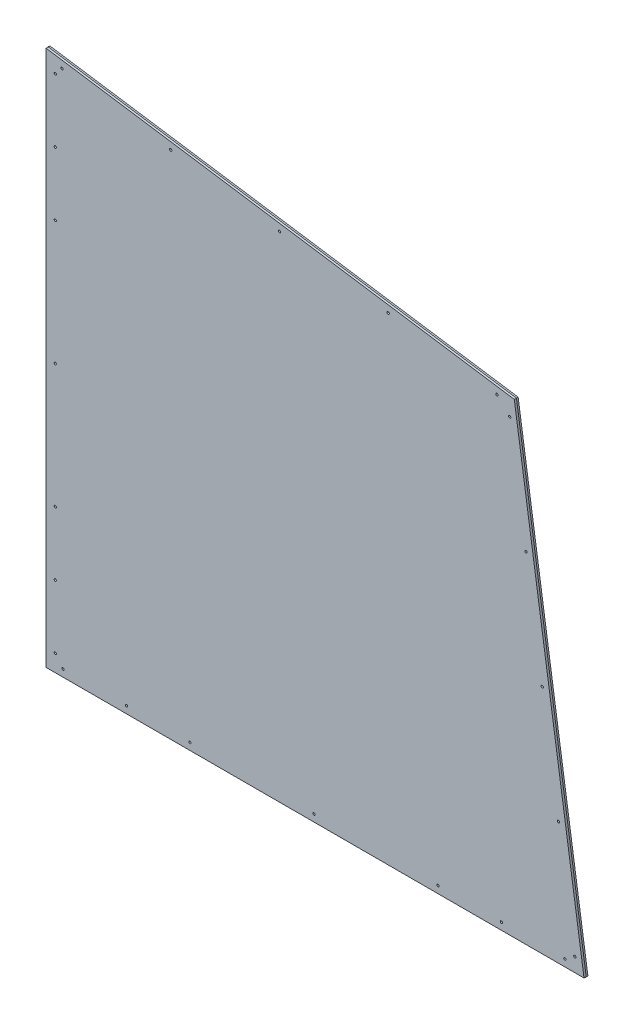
from build123d import *

# Parameters (mm, degrees)
BOSS_EXTRUDE1_DEPTH = 4.365625
CUT_EXTRUDE1_DEPTH  = 1734.85299245
CUT_EXTRUDE2_DEPTH  = 1731.733684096
SKETCH5_R           = 2.57937
CUT_EXTRUDE3_DEPTH  = 1715.789562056


with BuildPart() as part:
    # Sketch2 → Boss-Extrude1 (new, symmetric)
    with BuildSketch(Plane.XY):
        Polygon((0, 4.365625), (0, 1212.85), (1055.067217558, 1055.067217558), (1212.197131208, 4.365625), align=None)
    extrude(amount=BOSS_EXTRUDE1_DEPTH, both=True)

    # Sketch3 → Cut-Extrude1 (cut, through all, along a direction that is not the sketch's normal)
    with BuildSketch(Plane.ZY):
        Polygon((0, 1212.85), (4.365625, 1212.197131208), (4.365625, 1215.39), (-4.365625, 1215.39), (-4.365625, 1212.197131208), align=None)
    extrude(amount=-CUT_EXTRUDE1_DEPTH, dir=(-0.9890018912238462, 0.14790287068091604, 0), mode=Mode.SUBTRACT)

    # Sketch4 → Cut-Extrude2 (cut, through all, along a direction that is not the sketch's normal)
    with BuildSketch(Plane.XZ.offset(-4.365625)):
        Polygon((1212.197131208, 0), (1211.544262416, 4.365625), (1214.737131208, 4.365625), (1214.737131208, -4.365625), (1211.544262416, -4.365625), align=None)
    extrude(amount=-CUT_EXTRUDE2_DEPTH, dir=(0.14790287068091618, -0.9890018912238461, 0), mode=Mode.SUBTRACT)

    # Sketch5 → Cut-Extrude3 (cut, through all)
    with BuildSketch(Plane.XY.offset(4.365625)):
        with Locations((525.52918334, 1117.502273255)):
            Circle(SKETCH5_R)
        with Locations((770.455501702, 1080.87412733)):
            Circle(SKETCH5_R)
        with Locations((1015.381820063, 1044.245981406)):
            Circle(SKETCH5_R)
        with Locations((1044.245981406, 1015.381820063)):
            Circle(SKETCH5_R)
        with Locations((1080.87412733, 770.455501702)):
            Circle(SKETCH5_R)
        with Locations((1117.502273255, 525.52918334)):
            Circle(SKETCH5_R)
        with Locations((1154.130419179, 280.602864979)):
            Circle(SKETCH5_R)
        with Locations((1190.758565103, 35.676546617)):
            Circle(SKETCH5_R)
        with Locations((1168.4, 20.240625)):
            Circle(SKETCH5_R)
        with Locations((1025.525, 20.240625)):
            Circle(SKETCH5_R)
        with Locations((882.65, 20.240625)):
            Circle(SKETCH5_R)
        with Locations((603.25, 20.240625)):
            Circle(SKETCH5_R)
        with Locations((323.85, 20.240625)):
            Circle(SKETCH5_R)
        with Locations((180.975, 20.240625)):
            Circle(SKETCH5_R)
        with Locations((38.1, 20.240625)):
            Circle(SKETCH5_R)
        with Locations((20.6375, 42.465625)):
            Circle(SKETCH5_R)
        with Locations((20.6375, 185.340625)):
            Circle(SKETCH5_R)
        with Locations((20.6375, 328.215625)):
            Circle(SKETCH5_R)
        with Locations((20.6375, 607.615625)):
            Circle(SKETCH5_R)
        with Locations((20.6375, 887.015625)):
            Circle(SKETCH5_R)
        with Locations((20.6375, 1029.890625)):
            Circle(SKETCH5_R)
        with Locations((20.6375, 1172.765625)):
            Circle(SKETCH5_R)
        with Locations((35.676546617, 1190.758565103)):
            Circle(SKETCH5_R)
        with Locations((280.602864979, 1154.130419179)):
            Circle(SKETCH5_R)
    extrude(amount=-CUT_EXTRUDE3_DEPTH, mode=Mode.SUBTRACT)


solid = part.part
